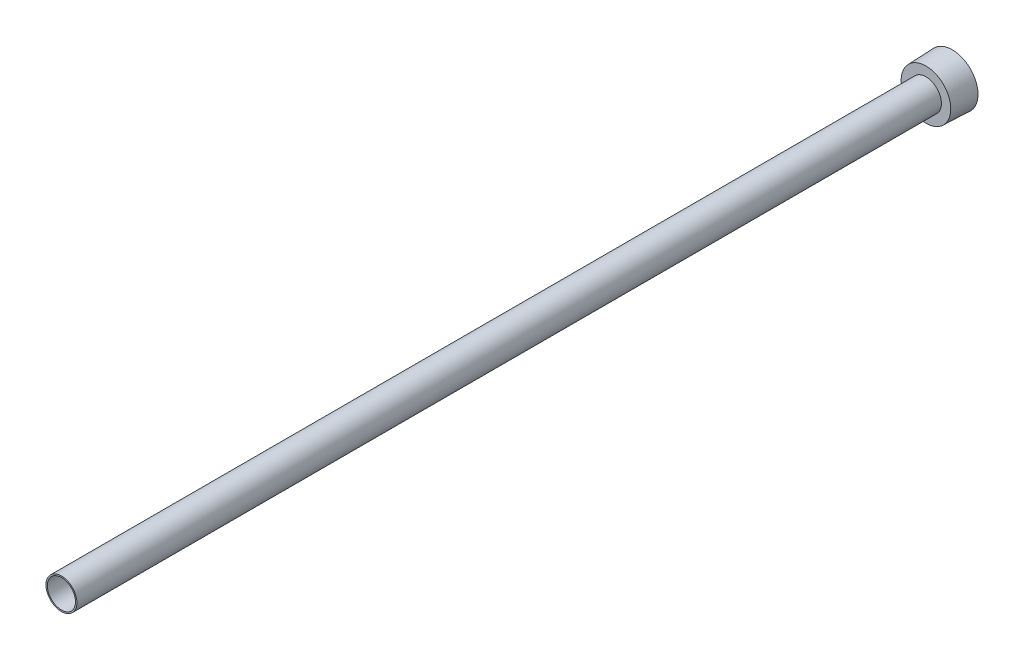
ISO-10303-21;
HEADER;
FILE_DESCRIPTION(('STEP AP214'),'2;1');
FILE_NAME('part.step','',(''),(''),'','','');
FILE_SCHEMA(('AUTOMOTIVE_DESIGN { 1 0 10303 214 1 1 1 1 }'));
ENDSEC;
DATA;
#1=APPLICATION_CONTEXT('core data for automotive mechanical design processes');
#2=APPLICATION_PROTOCOL_DEFINITION('international standard','automotive_design',2000,#1);
#3=PRODUCT_CONTEXT('',#1,'mechanical');
#4=PRODUCT('Part','Part','',(#3));
#5=PRODUCT_RELATED_PRODUCT_CATEGORY('part','',(#4));
#6=PRODUCT_DEFINITION_FORMATION('','',#4);
#7=PRODUCT_DEFINITION_CONTEXT('part definition',#1,'design');
#8=PRODUCT_DEFINITION('design','',#6,#7);
#9=PRODUCT_DEFINITION_SHAPE('','',#8);
#10=(LENGTH_UNIT() NAMED_UNIT(*) SI_UNIT(.MILLI.,.METRE.));
#11=(NAMED_UNIT(*) PLANE_ANGLE_UNIT() SI_UNIT($,.RADIAN.));
#12=(NAMED_UNIT(*) SI_UNIT($,.STERADIAN.) SOLID_ANGLE_UNIT());
#13=UNCERTAINTY_MEASURE_WITH_UNIT(LENGTH_MEASURE(1.E-05),#10,'distance_accuracy_value','');
#14=(GEOMETRIC_REPRESENTATION_CONTEXT(3) GLOBAL_UNCERTAINTY_ASSIGNED_CONTEXT((#13)) GLOBAL_UNIT_ASSIGNED_CONTEXT((#10,
#11,#12)) REPRESENTATION_CONTEXT('',''));
#15=CARTESIAN_POINT('',(0.,0.,0.));
#16=DIRECTION('',(0.,0.,1.));
#17=DIRECTION('',(1.,0.,0.));
#18=AXIS2_PLACEMENT_3D('',#15,#16,#17);
#19=CARTESIAN_POINT('',(0.,0.,0.));
#20=DIRECTION('',(0.,0.,1.));
#21=DIRECTION('',(1.,0.,0.));
#22=AXIS2_PLACEMENT_3D('',#19,#20,#21);
#23=CYLINDRICAL_SURFACE('',#22,7.2263);
#24=CARTESIAN_POINT('',(0.,0.,457.2));
#25=DIRECTION('',(0.,0.,1.));
#26=DIRECTION('',(1.,0.,0.));
#27=AXIS2_PLACEMENT_3D('',#24,#25,#26);
#28=CIRCLE('',#27,7.2263);
#29=CARTESIAN_POINT('',(7.2263,0.,457.2));
#30=VERTEX_POINT('',#29);
#31=EDGE_CURVE('E142',#30,#30,#28,.T.);
#32=ORIENTED_EDGE('',*,*,#31,.T.);
#33=EDGE_LOOP('',(#32));
#34=FACE_BOUND('',#33,.T.);
#35=CARTESIAN_POINT('',(0.,0.,9.525));
#36=DIRECTION('',(0.,0.,-1.));
#37=DIRECTION('',(-1.,0.,0.));
#38=AXIS2_PLACEMENT_3D('',#35,#36,#37);
#39=CIRCLE('',#38,7.2263);
#40=CARTESIAN_POINT('',(-7.2263,0.,9.525));
#41=VERTEX_POINT('',#40);
#42=EDGE_CURVE('E37',#41,#41,#39,.F.);
#43=ORIENTED_EDGE('',*,*,#42,.F.);
#44=EDGE_LOOP('',(#43));
#45=FACE_BOUND('',#44,.T.);
#46=ADVANCED_FACE('F33',(#34,#45),#23,.F.);
#47=CARTESIAN_POINT('',(0.,7.93749999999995,457.2));
#48=DIRECTION('',(0.,0.,-1.));
#49=DIRECTION('',(-1.,0.,0.));
#50=AXIS2_PLACEMENT_3D('',#47,#48,#49);
#51=PLANE('',#50);
#52=ORIENTED_EDGE('',*,*,#31,.F.);
#53=EDGE_LOOP('',(#52));
#54=FACE_BOUND('',#53,.T.);
#55=CARTESIAN_POINT('',(0.,0.,457.2));
#56=DIRECTION('',(0.,0.,1.));
#57=DIRECTION('',(1.,0.,0.));
#58=AXIS2_PLACEMENT_3D('',#55,#56,#57);
#59=CIRCLE('',#58,7.93749999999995);
#60=CARTESIAN_POINT('',(7.93749999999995,0.,457.2));
#61=VERTEX_POINT('',#60);
#62=EDGE_CURVE('E145',#61,#61,#59,.T.);
#63=ORIENTED_EDGE('',*,*,#62,.T.);
#64=EDGE_LOOP('',(#63));
#65=FACE_BOUND('',#64,.T.);
#66=ADVANCED_FACE('F35',(#54,#65),#51,.F.);
#67=CARTESIAN_POINT('',(0.,0.,0.));
#68=DIRECTION('',(0.,0.,1.));
#69=DIRECTION('',(1.,0.,0.));
#70=AXIS2_PLACEMENT_3D('',#67,#68,#69);
#71=PLANE('',#70);
#72=DIRECTION('',(-0.866025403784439,-0.5,0.));
#73=VECTOR('',#72,1.);
#74=CARTESIAN_POINT('',(9.525,-5.49926131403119,0.));
#75=LINE('',#74,#73);
#76=CARTESIAN_POINT('',(9.525,-5.49926131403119,0.));
#77=VERTEX_POINT('',#76);
#78=CARTESIAN_POINT('',(0.,-10.9985226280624,0.));
#79=VERTEX_POINT('',#78);
#80=EDGE_CURVE('E124',#77,#79,#75,.T.);
#81=ORIENTED_EDGE('',*,*,#80,.F.);
#82=DIRECTION('',(0.,-1.,0.));
#83=VECTOR('',#82,1.);
#84=CARTESIAN_POINT('',(9.525,5.49926131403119,0.));
#85=LINE('',#84,#83);
#86=CARTESIAN_POINT('',(9.525,5.49926131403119,0.));
#87=VERTEX_POINT('',#86);
#88=EDGE_CURVE('E49',#87,#77,#85,.T.);
#89=ORIENTED_EDGE('',*,*,#88,.F.);
#90=DIRECTION('',(0.866025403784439,-0.5,0.));
#91=VECTOR('',#90,1.);
#92=CARTESIAN_POINT('',(0.,10.9985226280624,0.));
#93=LINE('',#92,#91);
#94=CARTESIAN_POINT('',(0.,10.9985226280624,0.));
#95=VERTEX_POINT('',#94);
#96=EDGE_CURVE('E133',#95,#87,#93,.T.);
#97=ORIENTED_EDGE('',*,*,#96,.F.);
#98=DIRECTION('',(0.866025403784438,0.5,0.));
#99=VECTOR('',#98,1.);
#100=CARTESIAN_POINT('',(-9.525,5.49926131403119,0.));
#101=LINE('',#100,#99);
#102=CARTESIAN_POINT('',(-9.525,5.49926131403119,0.));
#103=VERTEX_POINT('',#102);
#104=EDGE_CURVE('E131',#103,#95,#101,.T.);
#105=ORIENTED_EDGE('',*,*,#104,.F.);
#106=DIRECTION('',(0.,1.,0.));
#107=VECTOR('',#106,1.);
#108=CARTESIAN_POINT('',(-9.525,-5.49926131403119,0.));
#109=LINE('',#108,#107);
#110=CARTESIAN_POINT('',(-9.525,-5.49926131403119,0.));
#111=VERTEX_POINT('',#110);
#112=EDGE_CURVE('E97',#111,#103,#109,.T.);
#113=ORIENTED_EDGE('',*,*,#112,.F.);
#114=DIRECTION('',(-0.866025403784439,0.5,0.));
#115=VECTOR('',#114,1.);
#116=CARTESIAN_POINT('',(0.,-10.9985226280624,0.));
#117=LINE('',#116,#115);
#118=EDGE_CURVE('E127',#79,#111,#117,.T.);
#119=ORIENTED_EDGE('',*,*,#118,.F.);
#120=EDGE_LOOP('',(#81,#89,#97,#105,#113,#119));
#121=FACE_BOUND('',#120,.T.);
#122=CARTESIAN_POINT('',(0.,0.,0.));
#123=DIRECTION('',(0.,0.,1.));
#124=DIRECTION('',(1.,0.,0.));
#125=AXIS2_PLACEMENT_3D('',#122,#123,#124);
#126=CIRCLE('',#125,13.2207);
#127=CARTESIAN_POINT('',(13.2207,0.,0.));
#128=VERTEX_POINT('',#127);
#129=EDGE_CURVE('E11',#128,#128,#126,.T.);
#130=ORIENTED_EDGE('',*,*,#129,.F.);
#131=EDGE_LOOP('',(#130));
#132=FACE_BOUND('',#131,.T.);
#133=ADVANCED_FACE('F159',(#121,#132),#71,.F.);
#134=CARTESIAN_POINT('',(0.,0.,0.));
#135=DIRECTION('',(0.,0.,-1.));
#136=DIRECTION('',(-1.,0.,0.));
#137=AXIS2_PLACEMENT_3D('',#134,#135,#136);
#138=CONICAL_SURFACE('',#137,13.2207,0.0364599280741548);
#139=CARTESIAN_POINT('',(0.,0.,13.4874));
#140=DIRECTION('',(0.,0.,1.));
#141=DIRECTION('',(1.,0.,0.));
#142=AXIS2_PLACEMENT_3D('',#139,#140,#141);
#143=CIRCLE('',#142,12.7287323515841);
#144=CARTESIAN_POINT('',(12.7287323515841,0.,13.4874));
#145=VERTEX_POINT('',#144);
#146=EDGE_CURVE('E42',#145,#145,#143,.T.);
#147=ORIENTED_EDGE('',*,*,#146,.F.);
#148=EDGE_LOOP('',(#147));
#149=FACE_BOUND('',#148,.T.);
#150=ORIENTED_EDGE('',*,*,#129,.T.);
#151=EDGE_LOOP('',(#150));
#152=FACE_BOUND('',#151,.T.);
#153=ADVANCED_FACE('F156',(#149,#152),#138,.T.);
#154=CARTESIAN_POINT('',(0.,12.7287323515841,13.4874));
#155=DIRECTION('',(0.,0.,-1.));
#156=DIRECTION('',(-1.,0.,0.));
#157=AXIS2_PLACEMENT_3D('',#154,#155,#156);
#158=PLANE('',#157);
#159=CARTESIAN_POINT('',(0.,0.,13.4874));
#160=DIRECTION('',(0.,0.,1.));
#161=DIRECTION('',(1.,0.,0.));
#162=AXIS2_PLACEMENT_3D('',#159,#160,#161);
#163=CIRCLE('',#162,7.9375);
#164=CARTESIAN_POINT('',(7.9375,0.,13.4874));
#165=VERTEX_POINT('',#164);
#166=EDGE_CURVE('E148',#165,#165,#163,.T.);
#167=ORIENTED_EDGE('',*,*,#166,.F.);
#168=EDGE_LOOP('',(#167));
#169=FACE_BOUND('',#168,.T.);
#170=ORIENTED_EDGE('',*,*,#146,.T.);
#171=EDGE_LOOP('',(#170));
#172=FACE_BOUND('',#171,.T.);
#173=ADVANCED_FACE('F154',(#169,#172),#158,.F.);
#174=CARTESIAN_POINT('',(0.,0.,278.00111462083));
#175=DIRECTION('',(0.,0.,1.));
#176=DIRECTION('',(1.,0.,0.));
#177=AXIS2_PLACEMENT_3D('',#174,#175,#176);
#178=CYLINDRICAL_SURFACE('',#177,7.93749999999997);
#179=ORIENTED_EDGE('',*,*,#62,.F.);
#180=EDGE_LOOP('',(#179));
#181=FACE_BOUND('',#180,.T.);
#182=ORIENTED_EDGE('',*,*,#166,.T.);
#183=EDGE_LOOP('',(#182));
#184=FACE_BOUND('',#183,.T.);
#185=ADVANCED_FACE('F180',(#181,#184),#178,.T.);
#186=CARTESIAN_POINT('',(9.525,-5.49926131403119,9.525));
#187=DIRECTION('',(0.,0.,-1.));
#188=DIRECTION('',(-1.,0.,0.));
#189=AXIS2_PLACEMENT_3D('',#186,#187,#188);
#190=PLANE('',#189);
#191=DIRECTION('',(0.,-1.,0.));
#192=VECTOR('',#191,1.);
#193=CARTESIAN_POINT('',(9.525,5.49926131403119,9.525));
#194=LINE('',#193,#192);
#195=CARTESIAN_POINT('',(9.525,5.49926131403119,9.525));
#196=VERTEX_POINT('',#195);
#197=CARTESIAN_POINT('',(9.525,-5.49926131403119,9.525));
#198=VERTEX_POINT('',#197);
#199=EDGE_CURVE('E135',#196,#198,#194,.T.);
#200=ORIENTED_EDGE('',*,*,#199,.T.);
#201=DIRECTION('',(-0.866025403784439,-0.5,0.));
#202=VECTOR('',#201,1.);
#203=CARTESIAN_POINT('',(9.525,-5.49926131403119,9.525));
#204=LINE('',#203,#202);
#205=CARTESIAN_POINT('',(0.,-10.9985226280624,9.525));
#206=VERTEX_POINT('',#205);
#207=EDGE_CURVE('E118',#198,#206,#204,.T.);
#208=ORIENTED_EDGE('',*,*,#207,.T.);
#209=DIRECTION('',(-0.866025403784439,0.5,0.));
#210=VECTOR('',#209,1.);
#211=CARTESIAN_POINT('',(0.,-10.9985226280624,9.525));
#212=LINE('',#211,#210);
#213=CARTESIAN_POINT('',(-9.525,-5.49926131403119,9.525));
#214=VERTEX_POINT('',#213);
#215=EDGE_CURVE('E116',#206,#214,#212,.T.);
#216=ORIENTED_EDGE('',*,*,#215,.T.);
#217=DIRECTION('',(0.,1.,0.));
#218=VECTOR('',#217,1.);
#219=CARTESIAN_POINT('',(-9.525,-5.49926131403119,9.525));
#220=LINE('',#219,#218);
#221=CARTESIAN_POINT('',(-9.525,5.49926131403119,9.525));
#222=VERTEX_POINT('',#221);
#223=EDGE_CURVE('E94',#214,#222,#220,.T.);
#224=ORIENTED_EDGE('',*,*,#223,.T.);
#225=DIRECTION('',(0.866025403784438,0.5,0.));
#226=VECTOR('',#225,1.);
#227=CARTESIAN_POINT('',(-9.525,5.49926131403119,9.525));
#228=LINE('',#227,#226);
#229=CARTESIAN_POINT('',(0.,10.9985226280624,9.525));
#230=VERTEX_POINT('',#229);
#231=EDGE_CURVE('E105',#222,#230,#228,.T.);
#232=ORIENTED_EDGE('',*,*,#231,.T.);
#233=DIRECTION('',(0.866025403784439,-0.5,0.));
#234=VECTOR('',#233,1.);
#235=CARTESIAN_POINT('',(0.,10.9985226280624,9.525));
#236=LINE('',#235,#234);
#237=EDGE_CURVE('E109',#230,#196,#236,.T.);
#238=ORIENTED_EDGE('',*,*,#237,.T.);
#239=EDGE_LOOP('',(#200,#208,#216,#224,#232,#238));
#240=FACE_BOUND('',#239,.T.);
#241=ORIENTED_EDGE('',*,*,#42,.T.);
#242=EDGE_LOOP('',(#241));
#243=FACE_BOUND('',#242,.T.);
#244=ADVANCED_FACE('F112',(#240,#243),#190,.T.);
#245=CARTESIAN_POINT('',(9.525,5.49926131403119,9.525));
#246=DIRECTION('',(1.,0.,0.));
#247=DIRECTION('',(0.,1.,0.));
#248=AXIS2_PLACEMENT_3D('',#245,#246,#247);
#249=PLANE('',#248);
#250=ORIENTED_EDGE('',*,*,#88,.T.);
#251=DIRECTION('',(0.,0.,-1.));
#252=VECTOR('',#251,1.);
#253=CARTESIAN_POINT('',(9.525,-5.49926131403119,9.525));
#254=LINE('',#253,#252);
#255=EDGE_CURVE('E79',#198,#77,#254,.T.);
#256=ORIENTED_EDGE('',*,*,#255,.F.);
#257=ORIENTED_EDGE('',*,*,#199,.F.);
#258=DIRECTION('',(0.,0.,-1.));
#259=VECTOR('',#258,1.);
#260=CARTESIAN_POINT('',(9.525,5.49926131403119,9.525));
#261=LINE('',#260,#259);
#262=EDGE_CURVE('E57',#196,#87,#261,.T.);
#263=ORIENTED_EDGE('',*,*,#262,.T.);
#264=EDGE_LOOP('',(#250,#256,#257,#263));
#265=FACE_BOUND('',#264,.T.);
#266=ADVANCED_FACE('F178',(#265),#249,.F.);
#267=CARTESIAN_POINT('',(0.,10.9985226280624,9.525));
#268=DIRECTION('',(0.5,0.866025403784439,0.));
#269=DIRECTION('',(-0.866025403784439,0.5,0.));
#270=AXIS2_PLACEMENT_3D('',#267,#268,#269);
#271=PLANE('',#270);
#272=ORIENTED_EDGE('',*,*,#96,.T.);
#273=ORIENTED_EDGE('',*,*,#262,.F.);
#274=ORIENTED_EDGE('',*,*,#237,.F.);
#275=DIRECTION('',(0.,0.,-1.));
#276=VECTOR('',#275,1.);
#277=CARTESIAN_POINT('',(0.,10.9985226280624,9.525));
#278=LINE('',#277,#276);
#279=EDGE_CURVE('E101',#230,#95,#278,.T.);
#280=ORIENTED_EDGE('',*,*,#279,.T.);
#281=EDGE_LOOP('',(#272,#273,#274,#280));
#282=FACE_BOUND('',#281,.T.);
#283=ADVANCED_FACE('F209',(#282),#271,.F.);
#284=CARTESIAN_POINT('',(-9.525,5.49926131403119,9.525));
#285=DIRECTION('',(-0.5,0.866025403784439,0.));
#286=DIRECTION('',(-0.866025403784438,-0.5,0.));
#287=AXIS2_PLACEMENT_3D('',#284,#285,#286);
#288=PLANE('',#287);
#289=ORIENTED_EDGE('',*,*,#104,.T.);
#290=ORIENTED_EDGE('',*,*,#279,.F.);
#291=ORIENTED_EDGE('',*,*,#231,.F.);
#292=DIRECTION('',(0.,0.,-1.));
#293=VECTOR('',#292,1.);
#294=CARTESIAN_POINT('',(-9.525,5.49926131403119,9.525));
#295=LINE('',#294,#293);
#296=EDGE_CURVE('E90',#222,#103,#295,.T.);
#297=ORIENTED_EDGE('',*,*,#296,.T.);
#298=EDGE_LOOP('',(#289,#290,#291,#297));
#299=FACE_BOUND('',#298,.T.);
#300=ADVANCED_FACE('F106',(#299),#288,.F.);
#301=CARTESIAN_POINT('',(-9.525,-5.49926131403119,9.525));
#302=DIRECTION('',(-1.,0.,0.));
#303=DIRECTION('',(0.,-1.,0.));
#304=AXIS2_PLACEMENT_3D('',#301,#302,#303);
#305=PLANE('',#304);
#306=ORIENTED_EDGE('',*,*,#112,.T.);
#307=ORIENTED_EDGE('',*,*,#296,.F.);
#308=ORIENTED_EDGE('',*,*,#223,.F.);
#309=DIRECTION('',(0.,0.,-1.));
#310=VECTOR('',#309,1.);
#311=CARTESIAN_POINT('',(-9.525,-5.49926131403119,9.525));
#312=LINE('',#311,#310);
#313=EDGE_CURVE('E102',#214,#111,#312,.T.);
#314=ORIENTED_EDGE('',*,*,#313,.T.);
#315=EDGE_LOOP('',(#306,#307,#308,#314));
#316=FACE_BOUND('',#315,.T.);
#317=ADVANCED_FACE('F92',(#316),#305,.F.);
#318=CARTESIAN_POINT('',(0.,-10.9985226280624,9.525));
#319=DIRECTION('',(-0.5,-0.866025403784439,0.));
#320=DIRECTION('',(0.866025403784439,-0.5,0.));
#321=AXIS2_PLACEMENT_3D('',#318,#319,#320);
#322=PLANE('',#321);
#323=ORIENTED_EDGE('',*,*,#118,.T.);
#324=ORIENTED_EDGE('',*,*,#313,.F.);
#325=ORIENTED_EDGE('',*,*,#215,.F.);
#326=DIRECTION('',(0.,0.,-1.));
#327=VECTOR('',#326,1.);
#328=CARTESIAN_POINT('',(0.,-10.9985226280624,9.525));
#329=LINE('',#328,#327);
#330=EDGE_CURVE('E139',#206,#79,#329,.T.);
#331=ORIENTED_EDGE('',*,*,#330,.T.);
#332=EDGE_LOOP('',(#323,#324,#325,#331));
#333=FACE_BOUND('',#332,.T.);
#334=ADVANCED_FACE('F227',(#333),#322,.F.);
#335=CARTESIAN_POINT('',(9.525,-5.49926131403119,9.525));
#336=DIRECTION('',(0.5,-0.866025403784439,0.));
#337=DIRECTION('',(0.866025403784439,0.5,0.));
#338=AXIS2_PLACEMENT_3D('',#335,#336,#337);
#339=PLANE('',#338);
#340=ORIENTED_EDGE('',*,*,#80,.T.);
#341=ORIENTED_EDGE('',*,*,#330,.F.);
#342=ORIENTED_EDGE('',*,*,#207,.F.);
#343=ORIENTED_EDGE('',*,*,#255,.T.);
#344=EDGE_LOOP('',(#340,#341,#342,#343));
#345=FACE_BOUND('',#344,.T.);
#346=ADVANCED_FACE('F234',(#345),#339,.F.);
#347=CLOSED_SHELL('',(#46,#66,#133,#153,#173,#185,#244,#266,#283,#300,#317,#334,#346));
#348=MANIFOLD_SOLID_BREP('B2',#347);
#349=ADVANCED_BREP_SHAPE_REPRESENTATION('',(#18,#348),#14);
#350=SHAPE_DEFINITION_REPRESENTATION(#9,#349);
ENDSEC;
END-ISO-10303-21;
